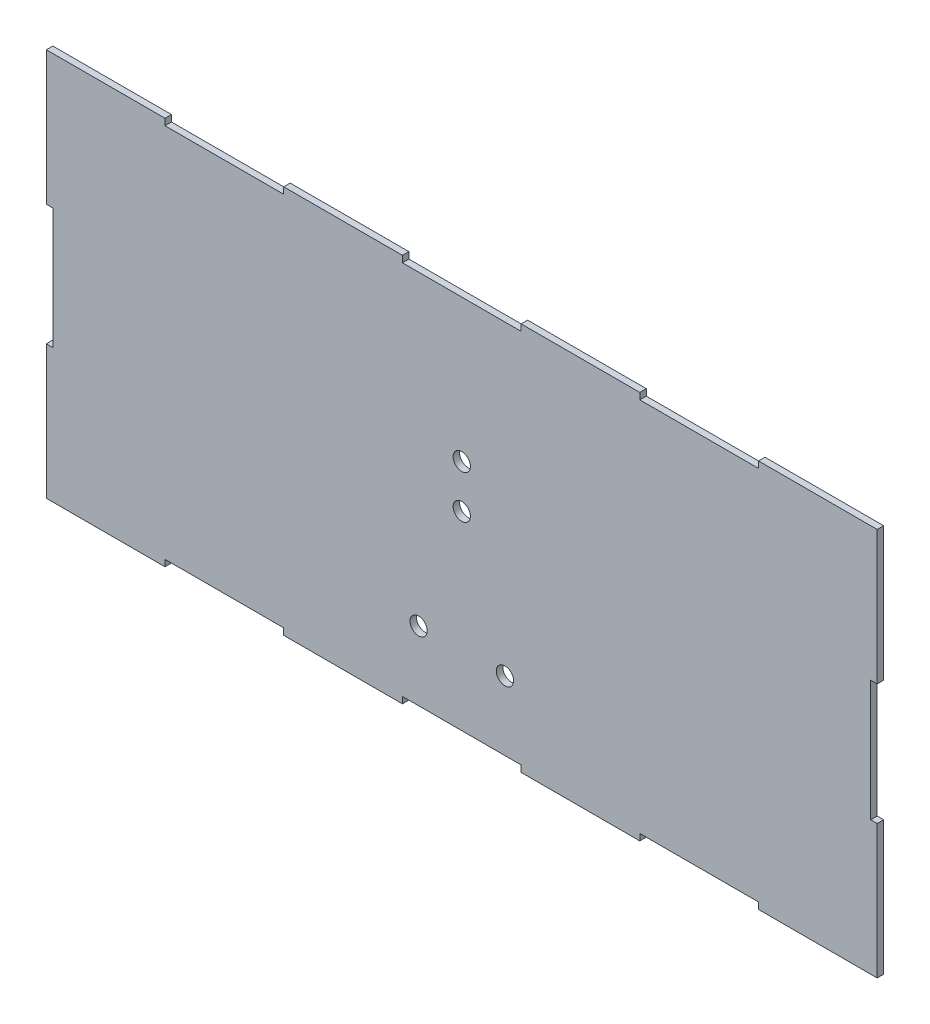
from build123d import *

# Parameters (mm, degrees)
ESQUISSE1_W             = 385
ESQUISSE1_H             = 180
ESQUISSE1_R             = 4
BOSS_EXTRU_1_DEPTH      = 3
ESQUISSE2_W             = 55
ESQUISSE2_H             = 3
ESQUISSE2_W_2           = 3
ESQUISSE2_H_2           = 56
ENL_V_MAT_EXTRU_1_DEPTH = 213.521175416


with BuildPart() as part:
    # Esquisse1 → Boss.-Extru.1 (new body)
    with BuildSketch(Plane.XY):
        Rectangle(ESQUISSE1_W, ESQUISSE1_H)
        with Locations((-20, -55)):
            Circle(ESQUISSE1_R, mode=Mode.SUBTRACT)
        with Locations((0, 21)):
            Circle(ESQUISSE1_R, mode=Mode.SUBTRACT)
        with Locations((0, 1)):
            Circle(ESQUISSE1_R, mode=Mode.SUBTRACT)
        with Locations(Location((20, -55, 0), (0, 0, 180))):
            Circle(ESQUISSE1_R, mode=Mode.SUBTRACT)
    extrude(amount=BOSS_EXTRU_1_DEPTH)

    # Esquisse2 → Enl_v. mat.-Extru.1 (cut, through all)
    with BuildSketch(Plane.XY.offset(3)):
        with Locations((110, -88.5)):
            Rectangle(ESQUISSE2_W, ESQUISSE2_H)
        with Locations((-110, -88.5)):
            Rectangle(ESQUISSE2_W, ESQUISSE2_H)
        with Locations((0, -88.5)):
            Rectangle(ESQUISSE2_W, ESQUISSE2_H)
        with Locations((110, 88.5)):
            Rectangle(ESQUISSE2_W, ESQUISSE2_H)
        with Locations((0, 88.5)):
            Rectangle(ESQUISSE2_W, ESQUISSE2_H)
        with Locations((-110, 88.5)):
            Rectangle(ESQUISSE2_W, ESQUISSE2_H)
        with Locations((-191, 0)):
            Rectangle(ESQUISSE2_W_2, ESQUISSE2_H_2)
        with Locations((191, 0)):
            Rectangle(ESQUISSE2_W_2, ESQUISSE2_H_2)
    extrude(amount=-ENL_V_MAT_EXTRU_1_DEPTH, mode=Mode.SUBTRACT)


solid = part.part
